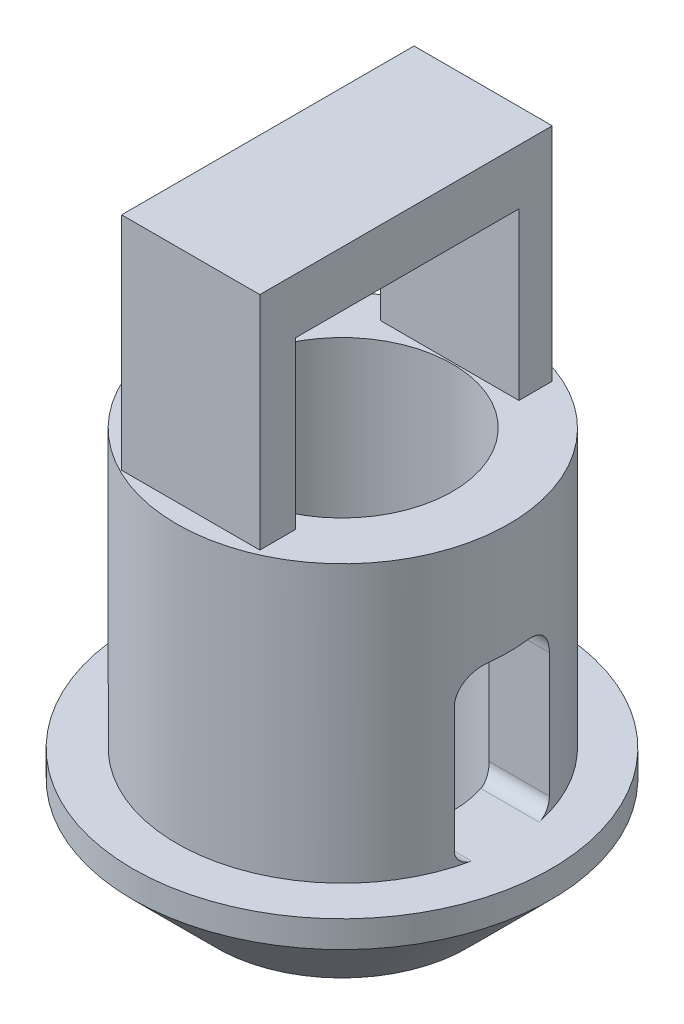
from build123d import *

# Parameters (mm, degrees)
SKETCH_1_R          = 6.004671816
EXTRUDE_1_DEPTH     = 10.009636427
SKETCH_3_W          = 13.151254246
SKETCH_3_H          = 3.4404717
CUT_EXTRUDE_1_DEPTH = 6
SKETCH_5_R          = 7.569787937
EXTRUDE_2_DEPTH     = 4
SKETCH_6_R          = 4
CUT_EXTRUDE_2_DEPTH = 18.652958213
SKETCH_7_W          = 5
SKETCH_7_H          = 1.293206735
EXTRUDE_3_DEPTH     = 8.005366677
SKETCH_9_W          = 5
SKETCH_9_H          = 2
EXTRUDE_4_DEPTH     = 9.286179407
SKETCH_10_W         = 5
SKETCH_10_H         = 1.205698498
EXTRUDE_5_DEPTH     = 6.029048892
FILLET_4_R          = 1
FILLET_5_R          = 0.5
CHAMFER_1_SIZE      = 3.034596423


with BuildPart() as part:
    # Sketch 1 → Extrude 1 (new body)
    with BuildSketch(Plane(origin=(0, 0, 0), x_dir=(1, 0, 0), z_dir=(0, 1, 0))):
        with Locations(Location((0.214557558, 0, 0), (0, 0, 270))):
            Circle(SKETCH_1_R)
    extrude(amount=EXTRUDE_1_DEPTH)

    # Sketch 3 → Cut-Extrude 1 (cut)
    with BuildSketch(Plane.XZ):
        Rectangle(SKETCH_3_W, SKETCH_3_H)
    extrude(amount=-CUT_EXTRUDE_1_DEPTH, mode=Mode.SUBTRACT)

    # Sketch 5 → Extrude 2 (add)
    with BuildSketch(Plane.XZ):
        with Locations(Location((0.207554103, 0.022949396, 0), (0, 0, 270))):
            Circle(SKETCH_5_R)
    extrude(amount=EXTRUDE_2_DEPTH)

    # Sketch 6 → Cut-Extrude 2 (cut, through all)
    with BuildSketch(Plane(origin=(0.180805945, 10.009636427, 0), x_dir=(1, 0, 0), z_dir=(0, 1, 0))):
        with Locations(Location((0, 0, 0), (0, 0, 270))):
            Circle(SKETCH_6_R)
    extrude(amount=-CUT_EXTRUDE_2_DEPTH, mode=Mode.SUBTRACT)

    # Sketch 7 → Extrude 3 (add)
    with BuildSketch(Plane(origin=(0, 10.009636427, 0), x_dir=(1, 0, 0), z_dir=(0, 1, 0))):
        with Locations((0.029186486, -4.670681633)):
            Rectangle(SKETCH_7_W, SKETCH_7_H)
    extrude(amount=EXTRUDE_3_DEPTH)

    # Sketch 9 → Extrude 4 (add)
    with BuildSketch(Plane(origin=(0, 0, 4.024078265), x_dir=(-1, 0, 0), z_dir=(0, 0, -1))):
        with Locations((-0.029186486, 17.015003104)):
            Rectangle(SKETCH_9_W, SKETCH_9_H)
    extrude(amount=EXTRUDE_4_DEPTH)

    # Sketch 10 → Extrude 5 (add)
    with BuildSketch(Plane.XZ.offset(-16.015003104)):
        with Locations((0.029186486, -4.659251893)):
            Rectangle(SKETCH_10_W, SKETCH_10_H)
    extrude(amount=EXTRUDE_5_DEPTH)

    # Fillet 4
    fillet_4_edges = [part.edges().sort_by_distance(p)[0] for p in [
        (4.879777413, 6, 1.72023585),
        (-4.48441391, 6, -1.72023585),
        (4.879777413, 6, -1.72023585),
        (-4.48441391, 6, 1.72023585),
    ]]
    fillet(fillet_4_edges, radius=FILLET_4_R)

    # Fillet 5
    fillet_5_edges = [part.edges().sort_by_distance(p)[0] for p in [
        (-4.48441391, 0, -1.72023585),
        (4.879777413, 0, 1.72023585),
        (4.879777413, 0, -1.72023585),
        (-4.48441391, 0, 1.72023585),
    ]]
    fillet(fillet_5_edges, radius=FILLET_5_R)

    # Chamfer 1
    chamfer_1_edges = [part.edges().sort_by_distance(p)[0] for p in [
        (0.207554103, -4, 7.592737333),
    ]]
    chamfer(chamfer_1_edges, length=CHAMFER_1_SIZE)


solid = part.part
